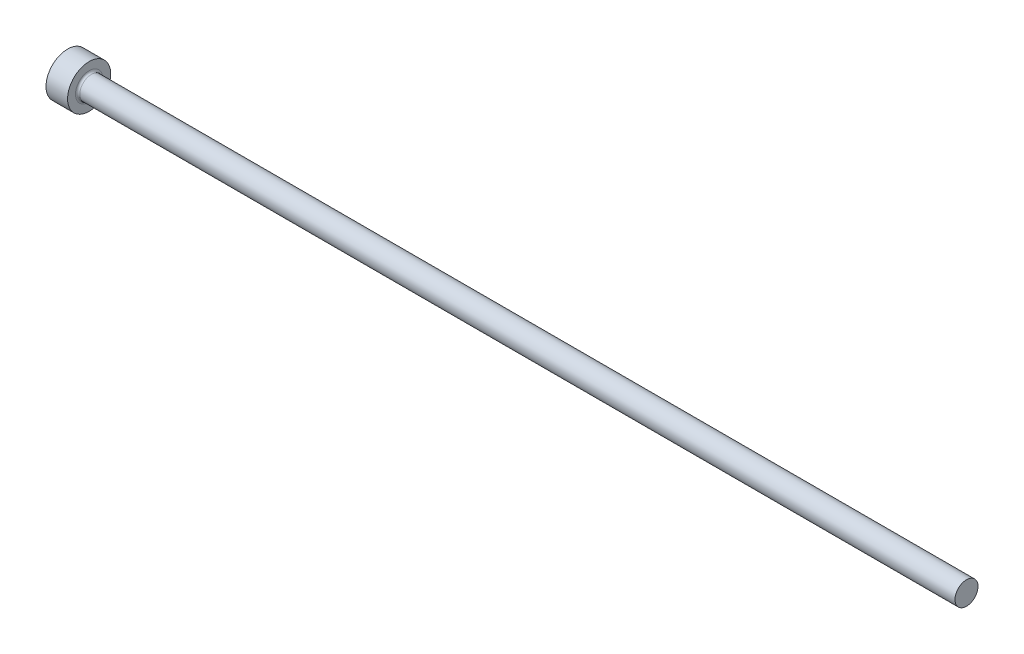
ISO-10303-21;
HEADER;
FILE_DESCRIPTION(('STEP AP214'),'2;1');
FILE_NAME('part.step','',(''),(''),'','','');
FILE_SCHEMA(('AUTOMOTIVE_DESIGN { 1 0 10303 214 1 1 1 1 }'));
ENDSEC;
DATA;
#1=APPLICATION_CONTEXT('core data for automotive mechanical design processes');
#2=APPLICATION_PROTOCOL_DEFINITION('international standard','automotive_design',2000,#1);
#3=PRODUCT_CONTEXT('',#1,'mechanical');
#4=PRODUCT('Part','Part','',(#3));
#5=PRODUCT_RELATED_PRODUCT_CATEGORY('part','',(#4));
#6=PRODUCT_DEFINITION_FORMATION('','',#4);
#7=PRODUCT_DEFINITION_CONTEXT('part definition',#1,'design');
#8=PRODUCT_DEFINITION('design','',#6,#7);
#9=PRODUCT_DEFINITION_SHAPE('','',#8);
#10=(LENGTH_UNIT() NAMED_UNIT(*) SI_UNIT(.MILLI.,.METRE.));
#11=(NAMED_UNIT(*) PLANE_ANGLE_UNIT() SI_UNIT($,.RADIAN.));
#12=(NAMED_UNIT(*) SI_UNIT($,.STERADIAN.) SOLID_ANGLE_UNIT());
#13=UNCERTAINTY_MEASURE_WITH_UNIT(LENGTH_MEASURE(1.E-05),#10,'distance_accuracy_value','');
#14=(GEOMETRIC_REPRESENTATION_CONTEXT(3) GLOBAL_UNCERTAINTY_ASSIGNED_CONTEXT((#13)) GLOBAL_UNIT_ASSIGNED_CONTEXT((#10,
#11,#12)) REPRESENTATION_CONTEXT('',''));
#15=CARTESIAN_POINT('',(0.,0.,0.));
#16=DIRECTION('',(0.,0.,1.));
#17=DIRECTION('',(1.,0.,0.));
#18=AXIS2_PLACEMENT_3D('',#15,#16,#17);
#19=CARTESIAN_POINT('',(0.,0.,0.));
#20=DIRECTION('',(-1.,0.,0.));
#21=DIRECTION('',(0.,-1.,0.));
#22=AXIS2_PLACEMENT_3D('',#19,#20,#21);
#23=PLANE('',#22);
#24=CARTESIAN_POINT('',(0.,0.,0.));
#25=DIRECTION('',(1.,0.,0.));
#26=DIRECTION('',(0.,1.,0.));
#27=AXIS2_PLACEMENT_3D('',#24,#25,#26);
#28=CIRCLE('',#27,3.);
#29=CARTESIAN_POINT('',(0.,3.,0.));
#30=VERTEX_POINT('',#29);
#31=EDGE_CURVE('E25',#30,#30,#28,.T.);
#32=ORIENTED_EDGE('',*,*,#31,.F.);
#33=EDGE_LOOP('',(#32));
#34=FACE_BOUND('',#33,.T.);
#35=ADVANCED_FACE('F14',(#34),#23,.T.);
#36=CARTESIAN_POINT('',(125.,0.,0.));
#37=DIRECTION('',(1.,0.,0.));
#38=DIRECTION('',(0.,1.,0.));
#39=AXIS2_PLACEMENT_3D('',#36,#37,#38);
#40=CYLINDRICAL_SURFACE('',#39,3.);
#41=ORIENTED_EDGE('',*,*,#31,.T.);
#42=EDGE_LOOP('',(#41));
#43=FACE_BOUND('',#42,.T.);
#44=CARTESIAN_POINT('',(3.,0.,0.));
#45=DIRECTION('',(1.,0.,0.));
#46=DIRECTION('',(0.,1.,0.));
#47=AXIS2_PLACEMENT_3D('',#44,#45,#46);
#48=CIRCLE('',#47,3.);
#49=CARTESIAN_POINT('',(3.,3.,0.));
#50=VERTEX_POINT('',#49);
#51=EDGE_CURVE('E29',#50,#50,#48,.T.);
#52=ORIENTED_EDGE('',*,*,#51,.F.);
#53=EDGE_LOOP('',(#52));
#54=FACE_BOUND('',#53,.T.);
#55=ADVANCED_FACE('F51',(#43,#54),#40,.T.);
#56=CARTESIAN_POINT('',(3.,3.,0.));
#57=DIRECTION('',(1.,0.,0.));
#58=DIRECTION('',(0.,1.,0.));
#59=AXIS2_PLACEMENT_3D('',#56,#57,#58);
#60=PLANE('',#59);
#61=CARTESIAN_POINT('',(3.,0.,0.));
#62=DIRECTION('',(1.,0.,0.));
#63=DIRECTION('',(0.,1.,0.));
#64=AXIS2_PLACEMENT_3D('',#61,#62,#63);
#65=CIRCLE('',#64,1.89999999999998);
#66=CARTESIAN_POINT('',(3.,1.89999999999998,0.));
#67=VERTEX_POINT('',#66);
#68=EDGE_CURVE('E9',#67,#67,#65,.F.);
#69=ORIENTED_EDGE('',*,*,#68,.T.);
#70=EDGE_LOOP('',(#69));
#71=FACE_BOUND('',#70,.T.);
#72=ORIENTED_EDGE('',*,*,#51,.T.);
#73=EDGE_LOOP('',(#72));
#74=FACE_BOUND('',#73,.T.);
#75=ADVANCED_FACE('F42',(#71,#74),#60,.T.);
#76=CARTESIAN_POINT('',(125.,0.,0.));
#77=DIRECTION('',(1.,0.,0.));
#78=DIRECTION('',(0.,1.,0.));
#79=AXIS2_PLACEMENT_3D('',#76,#77,#78);
#80=CYLINDRICAL_SURFACE('',#79,1.59999999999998);
#81=CARTESIAN_POINT('',(3.3,0.,0.));
#82=DIRECTION('',(1.,0.,0.));
#83=DIRECTION('',(0.,1.,0.));
#84=AXIS2_PLACEMENT_3D('',#81,#82,#83);
#85=CIRCLE('',#84,1.59999999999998);
#86=CARTESIAN_POINT('',(3.3,1.59999999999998,0.));
#87=VERTEX_POINT('',#86);
#88=EDGE_CURVE('E21',#87,#87,#85,.T.);
#89=ORIENTED_EDGE('',*,*,#88,.T.);
#90=EDGE_LOOP('',(#89));
#91=FACE_BOUND('',#90,.T.);
#92=CARTESIAN_POINT('',(125.,0.,0.));
#93=DIRECTION('',(1.,0.,0.));
#94=DIRECTION('',(0.,1.,0.));
#95=AXIS2_PLACEMENT_3D('',#92,#93,#94);
#96=CIRCLE('',#95,1.6);
#97=CARTESIAN_POINT('',(125.,1.6,0.));
#98=VERTEX_POINT('',#97);
#99=EDGE_CURVE('E34',#98,#98,#96,.T.);
#100=ORIENTED_EDGE('',*,*,#99,.F.);
#101=EDGE_LOOP('',(#100));
#102=FACE_BOUND('',#101,.T.);
#103=ADVANCED_FACE('F40',(#91,#102),#80,.T.);
#104=CARTESIAN_POINT('',(125.,1.6,0.));
#105=DIRECTION('',(1.,0.,0.));
#106=DIRECTION('',(0.,1.,0.));
#107=AXIS2_PLACEMENT_3D('',#104,#105,#106);
#108=PLANE('',#107);
#109=ORIENTED_EDGE('',*,*,#99,.T.);
#110=EDGE_LOOP('',(#109));
#111=FACE_BOUND('',#110,.T.);
#112=ADVANCED_FACE('F38',(#111),#108,.T.);
#113=CARTESIAN_POINT('',(3.3,0.,0.));
#114=DIRECTION('',(1.,0.,0.));
#115=DIRECTION('',(0.,1.,0.));
#116=AXIS2_PLACEMENT_3D('',#113,#114,#115);
#117=TOROIDAL_SURFACE('',#116,1.89999999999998,0.3);
#118=ORIENTED_EDGE('',*,*,#68,.F.);
#119=EDGE_LOOP('',(#118));
#120=FACE_BOUND('',#119,.T.);
#121=ORIENTED_EDGE('',*,*,#88,.F.);
#122=EDGE_LOOP('',(#121));
#123=FACE_BOUND('',#122,.T.);
#124=ADVANCED_FACE('F16',(#120,#123),#117,.F.);
#125=CLOSED_SHELL('',(#35,#55,#75,#103,#112,#124));
#126=MANIFOLD_SOLID_BREP('B1',#125);
#127=ADVANCED_BREP_SHAPE_REPRESENTATION('',(#18,#126),#14);
#128=SHAPE_DEFINITION_REPRESENTATION(#9,#127);
ENDSEC;
END-ISO-10303-21;
